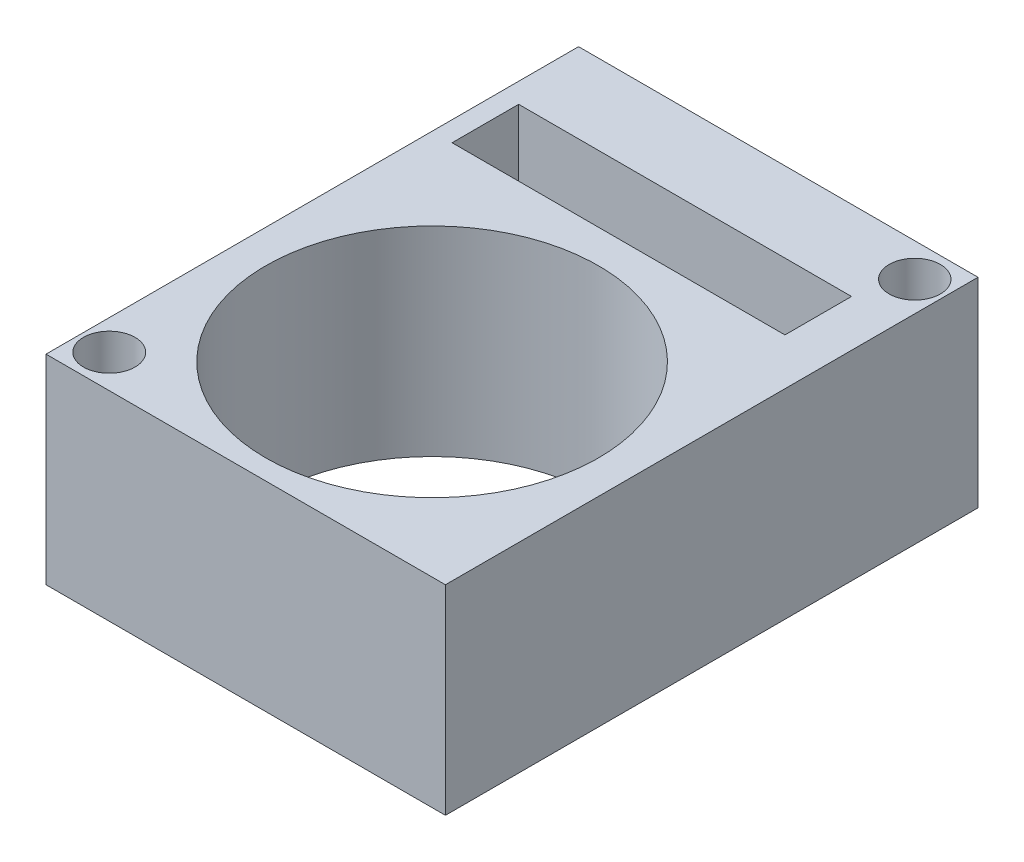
from build123d import *

# Parameters (mm, degrees)
SKETCH1_W          = 76.2
SKETCH1_H          = 101.6
EXTRUDE1_DEPTH     = 38.1
SKETCH2_R          = 31.75
CUT_EXTRUDE1_DEPTH = 38.1
SKETCH3_W          = 63.5
SKETCH3_H          = 12.7
CUT_EXTRUDE2_DEPTH = 50.8
SKETCH4_R          = 4.919257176
SKETCH4_R_2        = 4.888694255
CUT_EXTRUDE3_DEPTH = 50.8


with BuildPart() as part:
    # Sketch1 → Extrude1 (new body)
    with BuildSketch(Plane(origin=(0, 0, 0), x_dir=(1, 0, 0), z_dir=(0, 1, 0))):
        with Locations((-6.456884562, 5.721233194)):
            Rectangle(SKETCH1_W, SKETCH1_H)
    extrude(amount=EXTRUDE1_DEPTH)

    # Sketch2 → Cut-Extrude1 (cut)
    with BuildSketch(Plane(origin=(0, 38.1, 0), x_dir=(-1, 0, 0), z_dir=(0, 1, 0))):
        with Locations(Location((6.456884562, 9.518766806, 0), (0, 0, 90))):
            Circle(SKETCH2_R)
    extrude(amount=-CUT_EXTRUDE1_DEPTH, mode=Mode.SUBTRACT)

    # Sketch3 → Cut-Extrude2 (cut)
    with BuildSketch(Plane(origin=(0, 38.1, 0), x_dir=(-1, 0, 0), z_dir=(0, 1, 0))):
        with Locations((8.996884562, -34.931233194)):
            Rectangle(SKETCH3_W, SKETCH3_H)
    extrude(amount=-CUT_EXTRUDE2_DEPTH, mode=Mode.SUBTRACT)

    # Sketch4 → Cut-Extrude3 (cut)
    with BuildSketch(Plane.XZ):
        with Locations((-38.841884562, 38.728766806)):
            Circle(SKETCH4_R)
        with Locations((25.928115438, -50.171233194)):
            Circle(SKETCH4_R_2)
    extrude(amount=-CUT_EXTRUDE3_DEPTH, mode=Mode.SUBTRACT)


solid = part.part
